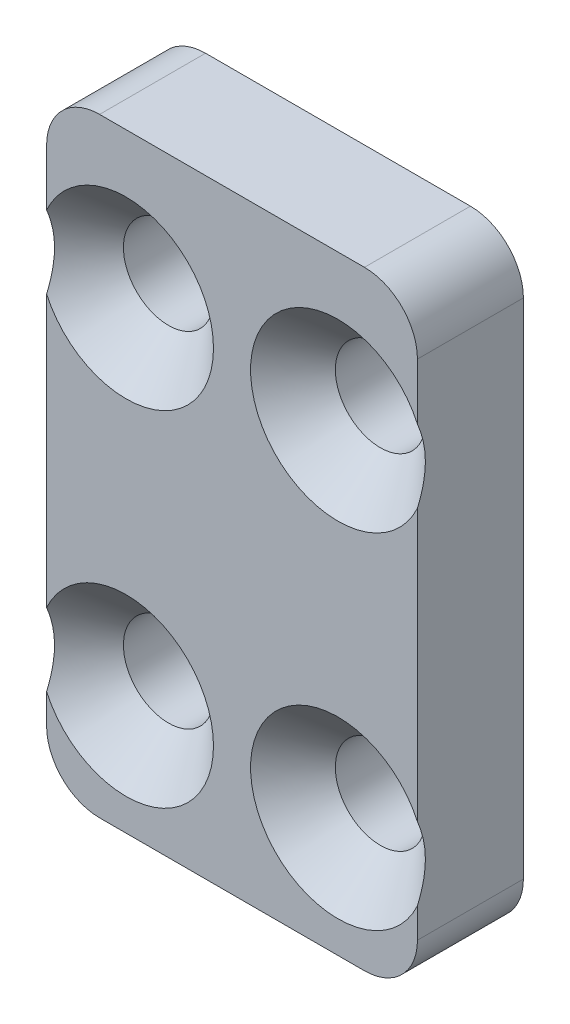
ISO-10303-21;
HEADER;
FILE_DESCRIPTION(('STEP AP214'),'2;1');
FILE_NAME('part.step','',(''),(''),'','','');
FILE_SCHEMA(('AUTOMOTIVE_DESIGN { 1 0 10303 214 1 1 1 1 }'));
ENDSEC;
DATA;
#1=APPLICATION_CONTEXT('core data for automotive mechanical design processes');
#2=APPLICATION_PROTOCOL_DEFINITION('international standard','automotive_design',2000,#1);
#3=PRODUCT_CONTEXT('',#1,'mechanical');
#4=PRODUCT('Part','Part','',(#3));
#5=PRODUCT_RELATED_PRODUCT_CATEGORY('part','',(#4));
#6=PRODUCT_DEFINITION_FORMATION('','',#4);
#7=PRODUCT_DEFINITION_CONTEXT('part definition',#1,'design');
#8=PRODUCT_DEFINITION('design','',#6,#7);
#9=PRODUCT_DEFINITION_SHAPE('','',#8);
#10=(LENGTH_UNIT() NAMED_UNIT(*) SI_UNIT(.MILLI.,.METRE.));
#11=(NAMED_UNIT(*) PLANE_ANGLE_UNIT() SI_UNIT($,.RADIAN.));
#12=(NAMED_UNIT(*) SI_UNIT($,.STERADIAN.) SOLID_ANGLE_UNIT());
#13=UNCERTAINTY_MEASURE_WITH_UNIT(LENGTH_MEASURE(1.E-05),#10,'distance_accuracy_value','');
#14=(GEOMETRIC_REPRESENTATION_CONTEXT(3) GLOBAL_UNCERTAINTY_ASSIGNED_CONTEXT((#13)) GLOBAL_UNIT_ASSIGNED_CONTEXT((#10,
#11,#12)) REPRESENTATION_CONTEXT('',''));
#15=CARTESIAN_POINT('',(0.,0.,0.));
#16=DIRECTION('',(0.,0.,1.));
#17=DIRECTION('',(1.,0.,0.));
#18=AXIS2_PLACEMENT_3D('',#15,#16,#17);
#19=CARTESIAN_POINT('',(7.,11.5,4.));
#20=DIRECTION('',(-1.,0.,0.));
#21=DIRECTION('',(0.,-1.,0.));
#22=AXIS2_PLACEMENT_3D('',#19,#20,#21);
#23=PLANE('',#22);
#24=DIRECTION('',(0.,1.,0.));
#25=VECTOR('',#24,1.);
#26=CARTESIAN_POINT('',(7.,11.5,4.));
#27=LINE('',#26,#25);
#28=CARTESIAN_POINT('',(7.,-9.5,4.));
#29=VERTEX_POINT('',#28);
#30=CARTESIAN_POINT('',(7.,-8.37477270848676,4.));
#31=VERTEX_POINT('',#30);
#32=EDGE_CURVE('E346',#29,#31,#27,.T.);
#33=ORIENTED_EDGE('',*,*,#32,.F.);
#34=DIRECTION('',(0.,0.,-1.));
#35=VECTOR('',#34,1.);
#36=CARTESIAN_POINT('',(7.,-9.5,4.));
#37=LINE('',#36,#35);
#38=CARTESIAN_POINT('',(7.,-9.5,0.));
#39=VERTEX_POINT('',#38);
#40=EDGE_CURVE('E292',#29,#39,#37,.T.);
#41=ORIENTED_EDGE('',*,*,#40,.T.);
#42=DIRECTION('',(0.,1.,0.));
#43=VECTOR('',#42,1.);
#44=CARTESIAN_POINT('',(7.,11.5,0.));
#45=LINE('',#44,#43);
#46=CARTESIAN_POINT('',(7.,9.5,0.));
#47=VERTEX_POINT('',#46);
#48=EDGE_CURVE('E161',#39,#47,#45,.T.);
#49=ORIENTED_EDGE('',*,*,#48,.T.);
#50=DIRECTION('',(0.,0.,-1.));
#51=VECTOR('',#50,1.);
#52=CARTESIAN_POINT('',(7.,9.5,4.));
#53=LINE('',#52,#51);
#54=CARTESIAN_POINT('',(7.,9.5,4.));
#55=VERTEX_POINT('',#54);
#56=EDGE_CURVE('E135',#47,#55,#53,.F.);
#57=ORIENTED_EDGE('',*,*,#56,.T.);
#58=CARTESIAN_POINT('',(7.,7.37477270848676,4.));
#59=VERTEX_POINT('',#58);
#60=EDGE_CURVE('E172',#59,#55,#27,.T.);
#61=ORIENTED_EDGE('',*,*,#60,.F.);
#62=CARTESIAN_POINT('',(7.,-5.36840136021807,12.4575741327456));
#63=CARTESIAN_POINT('',(7.,-5.07180927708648,12.1708251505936));
#64=CARTESIAN_POINT('',(7.,-4.7748761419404,11.8844273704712));
#65=CARTESIAN_POINT('',(7.,-4.18006128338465,11.3125770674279));
#66=CARTESIAN_POINT('',(7.,-3.8821794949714,11.0271246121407));
#67=CARTESIAN_POINT('',(7.,-3.28429415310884,10.4565431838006));
#68=CARTESIAN_POINT('',(7.,-2.98428686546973,10.1714181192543));
#69=CARTESIAN_POINT('',(7.,-2.38272797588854,9.60283572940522));
#70=CARTESIAN_POINT('',(7.,-2.08117646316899,9.31937830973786));
#71=CARTESIAN_POINT('',(7.,-1.43806962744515,8.71933506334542));
#72=CARTESIAN_POINT('',(7.,-1.09623513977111,8.40304741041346));
#73=CARTESIAN_POINT('',(7.,-0.580531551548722,7.93177603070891));
#74=CARTESIAN_POINT('',(7.,-0.408120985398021,7.7751967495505));
#75=CARTESIAN_POINT('',(7.,-0.0620916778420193,7.46337990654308));
#76=CARTESIAN_POINT('',(7.,0.111527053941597,7.30814233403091));
#77=CARTESIAN_POINT('',(7.,0.4599584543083,6.99964382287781));
#78=CARTESIAN_POINT('',(7.,0.634768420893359,6.84637983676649));
#79=CARTESIAN_POINT('',(7.,0.986288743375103,6.54205018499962));
#80=CARTESIAN_POINT('',(7.,1.16299905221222,6.3909844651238));
#81=CARTESIAN_POINT('',(7.,1.51882169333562,6.09181593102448));
#82=CARTESIAN_POINT('',(7.,1.69793326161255,5.94371221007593));
#83=CARTESIAN_POINT('',(7.,2.05936788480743,5.65148687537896));
#84=CARTESIAN_POINT('',(7.,2.24169060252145,5.50736484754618));
#85=CARTESIAN_POINT('',(7.,2.52171426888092,5.29289996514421));
#86=CARTESIAN_POINT('',(7.,2.61783062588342,5.22048880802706));
#87=CARTESIAN_POINT('',(7.,2.81143858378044,5.07751676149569));
#88=CARTESIAN_POINT('',(7.,2.90893022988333,5.00695593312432));
#89=CARTESIAN_POINT('',(7.,3.10566271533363,4.86801295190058));
#90=CARTESIAN_POINT('',(7.,3.20490580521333,4.799633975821));
#91=CARTESIAN_POINT('',(7.,3.40529553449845,4.66571968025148));
#92=CARTESIAN_POINT('',(7.,3.50644210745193,4.600184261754));
#93=CARTESIAN_POINT('',(7.,3.70934385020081,4.47371321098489));
#94=CARTESIAN_POINT('',(7.,3.81106343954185,4.41272079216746));
#95=CARTESIAN_POINT('',(7.,4.01705289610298,4.29512521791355));
#96=CARTESIAN_POINT('',(7.,4.12132323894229,4.23852288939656));
#97=CARTESIAN_POINT('',(7.,4.33251787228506,4.13107127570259));
#98=CARTESIAN_POINT('',(7.,4.43943568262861,4.08020936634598));
#99=CARTESIAN_POINT('',(7.,4.65638293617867,3.98569413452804));
#100=CARTESIAN_POINT('',(7.,4.76641047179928,3.94203650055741));
#101=CARTESIAN_POINT('',(7.,4.97106380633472,3.87035116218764));
#102=CARTESIAN_POINT('',(7.,5.06519782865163,3.84093106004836));
#103=CARTESIAN_POINT('',(7.,5.25552659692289,3.78963604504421));
#104=CARTESIAN_POINT('',(7.,5.35172123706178,3.76776074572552));
#105=CARTESIAN_POINT('',(7.,5.54513443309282,3.73280701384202));
#106=CARTESIAN_POINT('',(7.,5.64234358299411,3.71967737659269));
#107=CARTESIAN_POINT('',(7.,5.83758067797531,3.70282034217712));
#108=CARTESIAN_POINT('',(7.,5.93560854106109,3.69909201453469));
#109=CARTESIAN_POINT('',(7.,6.12884829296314,3.70125360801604));
#110=CARTESIAN_POINT('',(7.,6.22406327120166,3.70688105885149));
#111=CARTESIAN_POINT('',(7.,6.41355685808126,3.72690377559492));
#112=CARTESIAN_POINT('',(7.,6.5078354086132,3.74129958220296));
#113=CARTESIAN_POINT('',(7.,6.69534741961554,3.77814880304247));
#114=CARTESIAN_POINT('',(7.,6.78857165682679,3.8006484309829));
#115=CARTESIAN_POINT('',(7.,6.97303865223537,3.85261238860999));
#116=CARTESIAN_POINT('',(7.,7.06428124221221,3.88207730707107));
#117=CARTESIAN_POINT('',(7.,7.25544978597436,3.95073305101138));
#118=CARTESIAN_POINT('',(7.,7.3551068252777,3.99066609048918));
#119=CARTESIAN_POINT('',(7.,7.55184899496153,4.07644663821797));
#120=CARTESIAN_POINT('',(7.,7.6489332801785,4.12229606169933));
#121=CARTESIAN_POINT('',(7.,7.84087792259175,4.21879767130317));
#122=CARTESIAN_POINT('',(7.,7.93573411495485,4.26945807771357));
#123=CARTESIAN_POINT('',(7.,8.12329594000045,4.37455496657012));
#124=CARTESIAN_POINT('',(7.,8.21600193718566,4.42899080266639));
#125=CARTESIAN_POINT('',(7.,8.40076409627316,4.54164508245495));
#126=CARTESIAN_POINT('',(7.,8.49279544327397,4.59990403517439));
#127=CARTESIAN_POINT('',(7.,8.67520573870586,4.71894917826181));
#128=CARTESIAN_POINT('',(7.,8.76558464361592,4.77973543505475));
#129=CARTESIAN_POINT('',(7.,8.94482375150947,4.90330531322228));
#130=CARTESIAN_POINT('',(7.,9.03368543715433,4.96608679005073));
#131=CARTESIAN_POINT('',(7.,9.21017587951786,5.09334761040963));
#132=CARTESIAN_POINT('',(7.,9.29780468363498,5.15782688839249));
#133=CARTESIAN_POINT('',(7.,9.58906831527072,5.37578544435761));
#134=CARTESIAN_POINT('',(7.,9.79034243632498,5.53241954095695));
#135=CARTESIAN_POINT('',(7.,10.1887602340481,5.85087046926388));
#136=CARTESIAN_POINT('',(7.,10.3859032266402,6.01268814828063));
#137=CARTESIAN_POINT('',(7.,10.7772121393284,6.34005959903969));
#138=CARTESIAN_POINT('',(7.,10.971376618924,6.50561508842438));
#139=CARTESIAN_POINT('',(7.,11.357392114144,6.83940326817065));
#140=CARTESIAN_POINT('',(7.,11.5492430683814,7.0076360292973));
#141=CARTESIAN_POINT('',(7.,11.9315801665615,7.34648694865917));
#142=CARTESIAN_POINT('',(7.,12.1220623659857,7.51710955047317));
#143=CARTESIAN_POINT('',(7.,12.5016176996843,7.85991797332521));
#144=CARTESIAN_POINT('',(7.,12.6906908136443,8.03210381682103));
#145=CARTESIAN_POINT('',(7.,13.2561253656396,8.5503808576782));
#146=CARTESIAN_POINT('',(7.,13.6308163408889,8.89829367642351));
#147=CARTESIAN_POINT('',(7.,14.333315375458,9.55612567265));
#148=CARTESIAN_POINT('',(7.,14.6614506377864,9.86569673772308));
#149=CARTESIAN_POINT('',(7.,15.3160656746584,10.486640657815));
#150=CARTESIAN_POINT('',(7.,15.6425453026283,10.7980136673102));
#151=CARTESIAN_POINT('',(7.,16.2929592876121,11.420832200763));
#152=CARTESIAN_POINT('',(7.,16.6168986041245,11.7322725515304));
#153=CARTESIAN_POINT('',(7.,17.2637709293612,12.3561319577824));
#154=CARTESIAN_POINT('',(7.,17.5867040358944,12.6685509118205));
#155=CARTESIAN_POINT('',(7.,17.9092856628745,12.9813307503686));
#156=B_SPLINE_CURVE_WITH_KNOTS('',3,(#62,#63,#64,#65,#66,#67,#68,#69,#70,#71,#72,#73,#74,#75,
#76,#77,#78,#79,#80,#81,#82,#83,#84,#85,#86,#87,#88,#89,#90,#91,#92,#93,#94,#95,#96,#97,#98,#99,
#100,#101,#102,#103,#104,#105,#106,#107,#108,#109,#110,#111,#112,#113,#114,#115,#116,#117,#118,
#119,#120,#121,#122,#123,#124,#125,#126,#127,#128,#129,#130,#131,#132,#133,#134,#135,#136,#137,
#138,#139,#140,#141,#142,#143,#144,#145,#146,#147,#148,#149,#150,#151,#152,#153,#154,#155),
.UNSPECIFIED.,.F.,.F.,(4,2,2,2,2,2,2,2,2,2,2,2,2,2,2,2,2,2,2,2,2,2,2,2,2,2,2,2,2,2,2,2,2,2,2,2,
2,2,2,2,2,2,2,2,2,2,4),(0.,1.2376307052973,2.47534812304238,3.7169975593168,4.95857604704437,
6.35568684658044,7.05438204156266,7.75307167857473,8.45050736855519,9.14792582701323,
9.8451274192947,10.5422562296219,10.9032592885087,11.2642742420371,11.6257928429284,
11.9872988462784,12.3430255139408,12.6988190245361,13.053814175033,13.4085960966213,
13.7042074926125,13.9998037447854,14.2936537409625,14.5874746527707,14.8731908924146,
15.1589247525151,15.4463145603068,15.7337286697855,16.0555676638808,16.3775111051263,
16.7000148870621,17.022463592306,17.3491773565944,17.6758997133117,18.0022820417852,
18.3286517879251,19.0936235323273,19.8587209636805,20.6241774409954,21.3896541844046,
22.1568196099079,22.9239960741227,24.4578891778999,25.8112351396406,27.1646988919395,
28.5128012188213,29.8607681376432),.UNSPECIFIED.);
#157=CARTESIAN_POINT('',(7.,4.62522729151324,4.));
#158=VERTEX_POINT('',#157);
#159=EDGE_CURVE('E196',#59,#158,#156,.F.);
#160=ORIENTED_EDGE('',*,*,#159,.T.);
#161=CARTESIAN_POINT('',(7.,-5.62522729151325,4.));
#162=VERTEX_POINT('',#161);
#163=EDGE_CURVE('E349',#162,#158,#27,.T.);
#164=ORIENTED_EDGE('',*,*,#163,.F.);
#165=CARTESIAN_POINT('',(7.,-18.3684013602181,12.4575741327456));
#166=CARTESIAN_POINT('',(7.,-18.0718092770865,12.1708251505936));
#167=CARTESIAN_POINT('',(7.,-17.7748761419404,11.8844273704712));
#168=CARTESIAN_POINT('',(7.,-17.1800612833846,11.3125770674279));
#169=CARTESIAN_POINT('',(7.,-16.8821794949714,11.0271246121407));
#170=CARTESIAN_POINT('',(7.,-16.2842941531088,10.4565431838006));
#171=CARTESIAN_POINT('',(7.,-15.9842868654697,10.1714181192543));
#172=CARTESIAN_POINT('',(7.,-15.3827279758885,9.60283572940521));
#173=CARTESIAN_POINT('',(7.,-15.081176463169,9.31937830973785));
#174=CARTESIAN_POINT('',(7.,-14.4380696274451,8.71933506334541));
#175=CARTESIAN_POINT('',(7.,-14.0962351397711,8.40304741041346));
#176=CARTESIAN_POINT('',(7.,-13.5805315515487,7.93177603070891));
#177=CARTESIAN_POINT('',(7.,-13.408120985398,7.77519674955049));
#178=CARTESIAN_POINT('',(7.,-13.062091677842,7.46337990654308));
#179=CARTESIAN_POINT('',(7.,-12.8884729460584,7.30814233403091));
#180=CARTESIAN_POINT('',(7.,-12.5400415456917,6.99964382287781));
#181=CARTESIAN_POINT('',(7.,-12.3652315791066,6.84637983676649));
#182=CARTESIAN_POINT('',(7.,-12.0137112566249,6.54205018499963));
#183=CARTESIAN_POINT('',(7.,-11.8370009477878,6.3909844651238));
#184=CARTESIAN_POINT('',(7.,-11.4811783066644,6.09181593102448));
#185=CARTESIAN_POINT('',(7.,-11.3020667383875,5.94371221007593));
#186=CARTESIAN_POINT('',(7.,-10.9406321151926,5.65148687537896));
#187=CARTESIAN_POINT('',(7.,-10.7583093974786,5.50736484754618));
#188=CARTESIAN_POINT('',(7.,-10.4782857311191,5.29289996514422));
#189=CARTESIAN_POINT('',(7.,-10.3821693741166,5.22048880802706));
#190=CARTESIAN_POINT('',(7.,-10.1885614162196,5.07751676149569));
#191=CARTESIAN_POINT('',(7.,-10.0910697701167,5.00695593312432));
#192=CARTESIAN_POINT('',(7.,-9.89433728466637,4.86801295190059));
#193=CARTESIAN_POINT('',(7.,-9.79509419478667,4.799633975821));
#194=CARTESIAN_POINT('',(7.,-9.59470446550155,4.66571968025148));
#195=CARTESIAN_POINT('',(7.,-9.49355789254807,4.600184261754));
#196=CARTESIAN_POINT('',(7.,-9.29065614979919,4.47371321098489));
#197=CARTESIAN_POINT('',(7.,-9.18893656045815,4.41272079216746));
#198=CARTESIAN_POINT('',(7.,-8.98294710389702,4.29512521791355));
#199=CARTESIAN_POINT('',(7.,-8.87867676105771,4.23852288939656));
#200=CARTESIAN_POINT('',(7.,-8.66748212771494,4.13107127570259));
#201=CARTESIAN_POINT('',(7.,-8.56056431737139,4.08020936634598));
#202=CARTESIAN_POINT('',(7.,-8.34361706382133,3.98569413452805));
#203=CARTESIAN_POINT('',(7.,-8.23358952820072,3.94203650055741));
#204=CARTESIAN_POINT('',(7.,-8.02893619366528,3.87035116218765));
#205=CARTESIAN_POINT('',(7.,-7.93480217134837,3.84093106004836));
#206=CARTESIAN_POINT('',(7.,-7.74447340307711,3.78963604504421));
#207=CARTESIAN_POINT('',(7.,-7.64827876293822,3.76776074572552));
#208=CARTESIAN_POINT('',(7.,-7.45486556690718,3.73280701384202));
#209=CARTESIAN_POINT('',(7.,-7.35765641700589,3.7196773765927));
#210=CARTESIAN_POINT('',(7.,-7.16241932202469,3.70282034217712));
#211=CARTESIAN_POINT('',(7.,-7.06439145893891,3.69909201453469));
#212=CARTESIAN_POINT('',(7.,-6.87115170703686,3.70125360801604));
#213=CARTESIAN_POINT('',(7.,-6.77593672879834,3.70688105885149));
#214=CARTESIAN_POINT('',(7.,-6.58644314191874,3.72690377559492));
#215=CARTESIAN_POINT('',(7.,-6.4921645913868,3.74129958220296));
#216=CARTESIAN_POINT('',(7.,-6.30465258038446,3.77814880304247));
#217=CARTESIAN_POINT('',(7.,-6.21142834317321,3.8006484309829));
#218=CARTESIAN_POINT('',(7.,-6.02696134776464,3.85261238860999));
#219=CARTESIAN_POINT('',(7.,-5.93571875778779,3.88207730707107));
#220=CARTESIAN_POINT('',(7.,-5.74455021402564,3.95073305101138));
#221=CARTESIAN_POINT('',(7.,-5.64489317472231,3.99066609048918));
#222=CARTESIAN_POINT('',(7.,-5.44815100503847,4.07644663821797));
#223=CARTESIAN_POINT('',(7.,-5.3510667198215,4.12229606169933));
#224=CARTESIAN_POINT('',(7.,-5.15912207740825,4.21879767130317));
#225=CARTESIAN_POINT('',(7.,-5.06426588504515,4.26945807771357));
#226=CARTESIAN_POINT('',(7.,-4.87670405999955,4.37455496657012));
#227=CARTESIAN_POINT('',(7.,-4.78399806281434,4.42899080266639));
#228=CARTESIAN_POINT('',(7.,-4.59923590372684,4.54164508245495));
#229=CARTESIAN_POINT('',(7.,-4.50720455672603,4.59990403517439));
#230=CARTESIAN_POINT('',(7.,-4.32479426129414,4.71894917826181));
#231=CARTESIAN_POINT('',(7.,-4.23441535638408,4.77973543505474));
#232=CARTESIAN_POINT('',(7.,-4.05517624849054,4.90330531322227));
#233=CARTESIAN_POINT('',(7.,-3.96631456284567,4.96608679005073));
#234=CARTESIAN_POINT('',(7.,-3.78982412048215,5.09334761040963));
#235=CARTESIAN_POINT('',(7.,-3.70219531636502,5.15782688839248));
#236=CARTESIAN_POINT('',(7.,-3.41093168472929,5.3757854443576));
#237=CARTESIAN_POINT('',(7.,-3.20965756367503,5.53241954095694));
#238=CARTESIAN_POINT('',(7.,-2.81123976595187,5.85087046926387));
#239=CARTESIAN_POINT('',(7.,-2.61409677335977,6.01268814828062));
#240=CARTESIAN_POINT('',(7.,-2.22278786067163,6.34005959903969));
#241=CARTESIAN_POINT('',(7.,-2.02862338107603,6.50561508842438));
#242=CARTESIAN_POINT('',(7.,-1.64260788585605,6.83940326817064));
#243=CARTESIAN_POINT('',(7.,-1.45075693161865,7.00763602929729));
#244=CARTESIAN_POINT('',(7.,-1.06841983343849,7.34648694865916));
#245=CARTESIAN_POINT('',(7.,-0.877937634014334,7.51710955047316));
#246=CARTESIAN_POINT('',(7.,-0.498382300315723,7.8599179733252));
#247=CARTESIAN_POINT('',(7.,-0.309309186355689,8.03210381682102));
#248=CARTESIAN_POINT('',(7.,0.256125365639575,8.55038085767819));
#249=CARTESIAN_POINT('',(7.,0.630816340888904,8.8982936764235));
#250=CARTESIAN_POINT('',(7.,1.33331537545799,9.55612567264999));
#251=CARTESIAN_POINT('',(7.,1.66145063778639,9.86569673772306));
#252=CARTESIAN_POINT('',(7.,2.31606567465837,10.4866406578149));
#253=CARTESIAN_POINT('',(7.,2.64254530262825,10.7980136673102));
#254=CARTESIAN_POINT('',(7.,3.29295928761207,11.420832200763));
#255=CARTESIAN_POINT('',(7.,3.61689860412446,11.7322725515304));
#256=CARTESIAN_POINT('',(7.,4.26377092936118,12.3561319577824));
#257=CARTESIAN_POINT('',(7.,4.58670403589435,12.6685509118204));
#258=CARTESIAN_POINT('',(7.,4.90928566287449,12.9813307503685));
#259=B_SPLINE_CURVE_WITH_KNOTS('',3,(#165,#166,#167,#168,#169,#170,#171,#172,#173,#174,#175,
#176,#177,#178,#179,#180,#181,#182,#183,#184,#185,#186,#187,#188,#189,#190,#191,#192,#193,#194,
#195,#196,#197,#198,#199,#200,#201,#202,#203,#204,#205,#206,#207,#208,#209,#210,#211,#212,#213,
#214,#215,#216,#217,#218,#219,#220,#221,#222,#223,#224,#225,#226,#227,#228,#229,#230,#231,#232,
#233,#234,#235,#236,#237,#238,#239,#240,#241,#242,#243,#244,#245,#246,#247,#248,#249,#250,#251,
#252,#253,#254,#255,#256,#257,#258),.UNSPECIFIED.,.F.,.F.,(4,2,2,2,2,2,2,2,2,2,2,2,2,2,2,2,2,2,
2,2,2,2,2,2,2,2,2,2,2,2,2,2,2,2,2,2,2,2,2,2,2,2,2,2,2,2,4),(0.,1.2376307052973,2.47534812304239,
3.71699755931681,4.95857604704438,6.35568684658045,7.05438204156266,7.75307167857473,
8.45050736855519,9.14792582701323,9.8451274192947,10.5422562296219,10.9032592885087,
11.2642742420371,11.6257928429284,11.9872988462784,12.3430255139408,12.6988190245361,
13.053814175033,13.4085960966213,13.7042074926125,13.9998037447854,14.2936537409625,
14.5874746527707,14.8731908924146,15.1589247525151,15.4463145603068,15.7337286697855,
16.0555676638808,16.3775111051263,16.7000148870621,17.022463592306,17.3491773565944,
17.6758997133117,18.0022820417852,18.3286517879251,19.0936235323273,19.8587209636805,
20.6241774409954,21.3896541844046,22.1568196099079,22.9239960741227,24.4578891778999,
25.8112351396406,27.1646988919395,28.5128012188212,29.8607681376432),.UNSPECIFIED.);
#260=EDGE_CURVE('E160',#162,#31,#259,.F.);
#261=ORIENTED_EDGE('',*,*,#260,.T.);
#262=EDGE_LOOP('',(#33,#41,#49,#57,#61,#160,#164,#261));
#263=FACE_BOUND('',#262,.T.);
#264=ADVANCED_FACE('F39',(#263),#23,.F.);
#265=CARTESIAN_POINT('',(-7.,11.5,4.));
#266=DIRECTION('',(0.,-1.,0.));
#267=DIRECTION('',(0.,0.,-1.));
#268=AXIS2_PLACEMENT_3D('',#265,#266,#267);
#269=PLANE('',#268);
#270=DIRECTION('',(-1.,0.,0.));
#271=VECTOR('',#270,1.);
#272=CARTESIAN_POINT('',(-7.,11.5,4.));
#273=LINE('',#272,#271);
#274=CARTESIAN_POINT('',(5.,11.5,4.));
#275=VERTEX_POINT('',#274);
#276=CARTESIAN_POINT('',(-5.,11.5,4.));
#277=VERTEX_POINT('',#276);
#278=EDGE_CURVE('E155',#275,#277,#273,.T.);
#279=ORIENTED_EDGE('',*,*,#278,.F.);
#280=DIRECTION('',(0.,0.,-1.));
#281=VECTOR('',#280,1.);
#282=CARTESIAN_POINT('',(5.,11.5,4.));
#283=LINE('',#282,#281);
#284=CARTESIAN_POINT('',(5.,11.5,0.));
#285=VERTEX_POINT('',#284);
#286=EDGE_CURVE('E11',#275,#285,#283,.T.);
#287=ORIENTED_EDGE('',*,*,#286,.T.);
#288=DIRECTION('',(-1.,0.,0.));
#289=VECTOR('',#288,1.);
#290=CARTESIAN_POINT('',(-7.,11.5,0.));
#291=LINE('',#290,#289);
#292=CARTESIAN_POINT('',(-5.,11.5,0.));
#293=VERTEX_POINT('',#292);
#294=EDGE_CURVE('E164',#285,#293,#291,.T.);
#295=ORIENTED_EDGE('',*,*,#294,.T.);
#296=DIRECTION('',(0.,0.,-1.));
#297=VECTOR('',#296,1.);
#298=CARTESIAN_POINT('',(-5.,11.5,4.));
#299=LINE('',#298,#297);
#300=EDGE_CURVE('E47',#293,#277,#299,.F.);
#301=ORIENTED_EDGE('',*,*,#300,.T.);
#302=EDGE_LOOP('',(#279,#287,#295,#301));
#303=FACE_BOUND('',#302,.T.);
#304=ADVANCED_FACE('F189',(#303),#269,.F.);
#305=CARTESIAN_POINT('',(-7.,11.5,4.));
#306=DIRECTION('',(1.,0.,0.));
#307=DIRECTION('',(0.,1.,0.));
#308=AXIS2_PLACEMENT_3D('',#305,#306,#307);
#309=PLANE('',#308);
#310=DIRECTION('',(0.,-1.,0.));
#311=VECTOR('',#310,1.);
#312=CARTESIAN_POINT('',(-7.,11.5,0.));
#313=LINE('',#312,#311);
#314=CARTESIAN_POINT('',(-7.,9.5,0.));
#315=VERTEX_POINT('',#314);
#316=CARTESIAN_POINT('',(-7.,-9.5,0.));
#317=VERTEX_POINT('',#316);
#318=EDGE_CURVE('E167',#315,#317,#313,.T.);
#319=ORIENTED_EDGE('',*,*,#318,.T.);
#320=DIRECTION('',(0.,0.,-1.));
#321=VECTOR('',#320,1.);
#322=CARTESIAN_POINT('',(-7.,-9.5,4.));
#323=LINE('',#322,#321);
#324=CARTESIAN_POINT('',(-7.,-9.5,4.));
#325=VERTEX_POINT('',#324);
#326=EDGE_CURVE('E319',#317,#325,#323,.F.);
#327=ORIENTED_EDGE('',*,*,#326,.T.);
#328=DIRECTION('',(0.,-1.,0.));
#329=VECTOR('',#328,1.);
#330=CARTESIAN_POINT('',(-7.,11.5,4.));
#331=LINE('',#330,#329);
#332=CARTESIAN_POINT('',(-7.,-8.37477270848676,4.));
#333=VERTEX_POINT('',#332);
#334=EDGE_CURVE('E151',#333,#325,#331,.T.);
#335=ORIENTED_EDGE('',*,*,#334,.F.);
#336=CARTESIAN_POINT('',(-7.,-18.3684013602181,12.4575741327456));
#337=CARTESIAN_POINT('',(-7.,-18.0718092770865,12.1708251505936));
#338=CARTESIAN_POINT('',(-7.,-17.7748761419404,11.8844273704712));
#339=CARTESIAN_POINT('',(-7.,-17.1800612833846,11.3125770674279));
#340=CARTESIAN_POINT('',(-7.,-16.8821794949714,11.0271246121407));
#341=CARTESIAN_POINT('',(-7.,-16.2842941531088,10.4565431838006));
#342=CARTESIAN_POINT('',(-7.,-15.9842868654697,10.1714181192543));
#343=CARTESIAN_POINT('',(-7.,-15.3827279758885,9.60283572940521));
#344=CARTESIAN_POINT('',(-7.,-15.081176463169,9.31937830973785));
#345=CARTESIAN_POINT('',(-7.,-14.4380696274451,8.71933506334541));
#346=CARTESIAN_POINT('',(-7.,-14.0962351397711,8.40304741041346));
#347=CARTESIAN_POINT('',(-7.,-13.5805315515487,7.93177603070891));
#348=CARTESIAN_POINT('',(-7.,-13.408120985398,7.77519674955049));
#349=CARTESIAN_POINT('',(-7.,-13.062091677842,7.46337990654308));
#350=CARTESIAN_POINT('',(-7.,-12.8884729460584,7.30814233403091));
#351=CARTESIAN_POINT('',(-7.,-12.5400415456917,6.99964382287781));
#352=CARTESIAN_POINT('',(-7.,-12.3652315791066,6.84637983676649));
#353=CARTESIAN_POINT('',(-7.,-12.0137112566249,6.54205018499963));
#354=CARTESIAN_POINT('',(-7.,-11.8370009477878,6.3909844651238));
#355=CARTESIAN_POINT('',(-7.,-11.4811783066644,6.09181593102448));
#356=CARTESIAN_POINT('',(-7.,-11.3020667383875,5.94371221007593));
#357=CARTESIAN_POINT('',(-7.,-10.9406321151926,5.65148687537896));
#358=CARTESIAN_POINT('',(-7.,-10.7583093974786,5.50736484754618));
#359=CARTESIAN_POINT('',(-7.,-10.4782857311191,5.29289996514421));
#360=CARTESIAN_POINT('',(-7.,-10.3821693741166,5.22048880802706));
#361=CARTESIAN_POINT('',(-7.,-10.1885614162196,5.07751676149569));
#362=CARTESIAN_POINT('',(-7.,-10.0910697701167,5.00695593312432));
#363=CARTESIAN_POINT('',(-7.,-9.89433728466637,4.86801295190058));
#364=CARTESIAN_POINT('',(-7.,-9.79509419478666,4.799633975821));
#365=CARTESIAN_POINT('',(-7.,-9.59470446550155,4.66571968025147));
#366=CARTESIAN_POINT('',(-7.,-9.49355789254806,4.600184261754));
#367=CARTESIAN_POINT('',(-7.,-9.29065614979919,4.47371321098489));
#368=CARTESIAN_POINT('',(-7.,-9.18893656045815,4.41272079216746));
#369=CARTESIAN_POINT('',(-7.,-8.98294710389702,4.29512521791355));
#370=CARTESIAN_POINT('',(-7.,-8.87867676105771,4.23852288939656));
#371=CARTESIAN_POINT('',(-7.,-8.66748212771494,4.13107127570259));
#372=CARTESIAN_POINT('',(-7.,-8.56056431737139,4.08020936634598));
#373=CARTESIAN_POINT('',(-7.,-8.34361706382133,3.98569413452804));
#374=CARTESIAN_POINT('',(-7.,-8.23358952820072,3.94203650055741));
#375=CARTESIAN_POINT('',(-7.,-8.02893619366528,3.87035116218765));
#376=CARTESIAN_POINT('',(-7.,-7.93480217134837,3.84093106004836));
#377=CARTESIAN_POINT('',(-7.,-7.74447340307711,3.78963604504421));
#378=CARTESIAN_POINT('',(-7.,-7.64827876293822,3.76776074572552));
#379=CARTESIAN_POINT('',(-7.,-7.45486556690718,3.73280701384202));
#380=CARTESIAN_POINT('',(-7.,-7.35765641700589,3.7196773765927));
#381=CARTESIAN_POINT('',(-7.,-7.16241932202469,3.70282034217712));
#382=CARTESIAN_POINT('',(-7.,-7.06439145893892,3.69909201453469));
#383=CARTESIAN_POINT('',(-7.,-6.87115170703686,3.70125360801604));
#384=CARTESIAN_POINT('',(-7.,-6.77593672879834,3.70688105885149));
#385=CARTESIAN_POINT('',(-7.,-6.58644314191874,3.72690377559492));
#386=CARTESIAN_POINT('',(-7.,-6.4921645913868,3.74129958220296));
#387=CARTESIAN_POINT('',(-7.,-6.30465258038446,3.77814880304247));
#388=CARTESIAN_POINT('',(-7.,-6.21142834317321,3.8006484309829));
#389=CARTESIAN_POINT('',(-7.,-6.02696134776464,3.85261238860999));
#390=CARTESIAN_POINT('',(-7.,-5.93571875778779,3.88207730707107));
#391=CARTESIAN_POINT('',(-7.,-5.74455021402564,3.95073305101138));
#392=CARTESIAN_POINT('',(-7.,-5.64489317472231,3.99066609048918));
#393=CARTESIAN_POINT('',(-7.,-5.44815100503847,4.07644663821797));
#394=CARTESIAN_POINT('',(-7.,-5.3510667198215,4.12229606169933));
#395=CARTESIAN_POINT('',(-7.,-5.15912207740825,4.21879767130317));
#396=CARTESIAN_POINT('',(-7.,-5.06426588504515,4.26945807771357));
#397=CARTESIAN_POINT('',(-7.,-4.87670405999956,4.37455496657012));
#398=CARTESIAN_POINT('',(-7.,-4.78399806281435,4.42899080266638));
#399=CARTESIAN_POINT('',(-7.,-4.59923590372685,4.54164508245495));
#400=CARTESIAN_POINT('',(-7.,-4.50720455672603,4.59990403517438));
#401=CARTESIAN_POINT('',(-7.,-4.32479426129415,4.71894917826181));
#402=CARTESIAN_POINT('',(-7.,-4.23441535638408,4.77973543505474));
#403=CARTESIAN_POINT('',(-7.,-4.05517624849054,4.90330531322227));
#404=CARTESIAN_POINT('',(-7.,-3.96631456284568,4.96608679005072));
#405=CARTESIAN_POINT('',(-7.,-3.78982412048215,5.09334761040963));
#406=CARTESIAN_POINT('',(-7.,-3.70219531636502,5.15782688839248));
#407=CARTESIAN_POINT('',(-7.,-3.41093168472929,5.3757854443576));
#408=CARTESIAN_POINT('',(-7.,-3.20965756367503,5.53241954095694));
#409=CARTESIAN_POINT('',(-7.,-2.81123976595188,5.85087046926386));
#410=CARTESIAN_POINT('',(-7.,-2.61409677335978,6.01268814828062));
#411=CARTESIAN_POINT('',(-7.,-2.22278786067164,6.34005959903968));
#412=CARTESIAN_POINT('',(-7.,-2.02862338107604,6.50561508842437));
#413=CARTESIAN_POINT('',(-7.,-1.64260788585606,6.83940326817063));
#414=CARTESIAN_POINT('',(-7.,-1.45075693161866,7.00763602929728));
#415=CARTESIAN_POINT('',(-7.,-1.0684198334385,7.34648694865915));
#416=CARTESIAN_POINT('',(-7.,-0.877937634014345,7.51710955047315));
#417=CARTESIAN_POINT('',(-7.,-0.498382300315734,7.8599179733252));
#418=CARTESIAN_POINT('',(-7.,-0.309309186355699,8.03210381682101));
#419=CARTESIAN_POINT('',(-7.,0.256125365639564,8.55038085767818));
#420=CARTESIAN_POINT('',(-7.,0.630816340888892,8.89829367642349));
#421=CARTESIAN_POINT('',(-7.,1.33331537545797,9.55612567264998));
#422=CARTESIAN_POINT('',(-7.,1.66145063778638,9.86569673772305));
#423=CARTESIAN_POINT('',(-7.,2.31606567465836,10.4866406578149));
#424=CARTESIAN_POINT('',(-7.,2.64254530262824,10.7980136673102));
#425=CARTESIAN_POINT('',(-7.,3.29295928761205,11.420832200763));
#426=CARTESIAN_POINT('',(-7.,3.61689860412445,11.7322725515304));
#427=CARTESIAN_POINT('',(-7.,4.26377092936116,12.3561319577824));
#428=CARTESIAN_POINT('',(-7.,4.58670403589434,12.6685509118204));
#429=CARTESIAN_POINT('',(-7.,4.90928566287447,12.9813307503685));
#430=B_SPLINE_CURVE_WITH_KNOTS('',3,(#336,#337,#338,#339,#340,#341,#342,#343,#344,#345,#346,
#347,#348,#349,#350,#351,#352,#353,#354,#355,#356,#357,#358,#359,#360,#361,#362,#363,#364,#365,
#366,#367,#368,#369,#370,#371,#372,#373,#374,#375,#376,#377,#378,#379,#380,#381,#382,#383,#384,
#385,#386,#387,#388,#389,#390,#391,#392,#393,#394,#395,#396,#397,#398,#399,#400,#401,#402,#403,
#404,#405,#406,#407,#408,#409,#410,#411,#412,#413,#414,#415,#416,#417,#418,#419,#420,#421,#422,
#423,#424,#425,#426,#427,#428,#429),.UNSPECIFIED.,.F.,.F.,(4,2,2,2,2,2,2,2,2,2,2,2,2,2,2,2,2,2,
2,2,2,2,2,2,2,2,2,2,2,2,2,2,2,2,2,2,2,2,2,2,2,2,2,2,2,2,4),(0.,1.2376307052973,2.47534812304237,
3.71699755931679,4.95857604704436,6.35568684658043,7.05438204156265,7.75307167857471,
8.45050736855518,9.14792582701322,9.84512741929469,10.5422562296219,10.9032592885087,
11.2642742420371,11.6257928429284,11.9872988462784,12.3430255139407,12.6988190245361,
13.053814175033,13.4085960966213,13.7042074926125,13.9998037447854,14.2936537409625,
14.5874746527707,14.8731908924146,15.1589247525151,15.4463145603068,15.7337286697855,
16.0555676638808,16.3775111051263,16.7000148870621,17.022463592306,17.3491773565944,
17.6758997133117,18.0022820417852,18.3286517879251,19.0936235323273,19.8587209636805,
20.6241774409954,21.3896541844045,22.1568196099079,22.9239960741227,24.4578891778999,
25.8112351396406,27.1646988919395,28.5128012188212,29.8607681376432),.UNSPECIFIED.);
#431=CARTESIAN_POINT('',(-7.,-5.62522729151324,4.));
#432=VERTEX_POINT('',#431);
#433=EDGE_CURVE('E150',#333,#432,#430,.T.);
#434=ORIENTED_EDGE('',*,*,#433,.T.);
#435=CARTESIAN_POINT('',(-7.,4.62522729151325,4.));
#436=VERTEX_POINT('',#435);
#437=EDGE_CURVE('E141',#436,#432,#331,.T.);
#438=ORIENTED_EDGE('',*,*,#437,.F.);
#439=CARTESIAN_POINT('',(-7.,-5.36840136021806,12.4575741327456));
#440=CARTESIAN_POINT('',(-7.,-5.07180927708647,12.1708251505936));
#441=CARTESIAN_POINT('',(-7.,-4.77487614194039,11.8844273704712));
#442=CARTESIAN_POINT('',(-7.,-4.18006128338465,11.3125770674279));
#443=CARTESIAN_POINT('',(-7.,-3.88217949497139,11.0271246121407));
#444=CARTESIAN_POINT('',(-7.,-3.28429415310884,10.4565431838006));
#445=CARTESIAN_POINT('',(-7.,-2.98428686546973,10.1714181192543));
#446=CARTESIAN_POINT('',(-7.,-2.38272797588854,9.60283572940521));
#447=CARTESIAN_POINT('',(-7.,-2.08117646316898,9.31937830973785));
#448=CARTESIAN_POINT('',(-7.,-1.43806962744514,8.71933506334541));
#449=CARTESIAN_POINT('',(-7.,-1.0962351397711,8.40304741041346));
#450=CARTESIAN_POINT('',(-7.,-0.580531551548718,7.93177603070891));
#451=CARTESIAN_POINT('',(-7.,-0.408120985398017,7.77519674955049));
#452=CARTESIAN_POINT('',(-7.,-0.0620916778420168,7.46337990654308));
#453=CARTESIAN_POINT('',(-7.,0.111527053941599,7.30814233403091));
#454=CARTESIAN_POINT('',(-7.,0.4599584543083,6.99964382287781));
#455=CARTESIAN_POINT('',(-7.,0.634768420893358,6.84637983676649));
#456=CARTESIAN_POINT('',(-7.,0.986288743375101,6.54205018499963));
#457=CARTESIAN_POINT('',(-7.,1.16299905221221,6.3909844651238));
#458=CARTESIAN_POINT('',(-7.,1.51882169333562,6.09181593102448));
#459=CARTESIAN_POINT('',(-7.,1.69793326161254,5.94371221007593));
#460=CARTESIAN_POINT('',(-7.,2.05936788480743,5.65148687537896));
#461=CARTESIAN_POINT('',(-7.,2.24169060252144,5.50736484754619));
#462=CARTESIAN_POINT('',(-7.,2.52171426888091,5.29289996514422));
#463=CARTESIAN_POINT('',(-7.,2.61783062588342,5.22048880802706));
#464=CARTESIAN_POINT('',(-7.,2.81143858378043,5.0775167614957));
#465=CARTESIAN_POINT('',(-7.,2.90893022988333,5.00695593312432));
#466=CARTESIAN_POINT('',(-7.,3.10566271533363,4.86801295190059));
#467=CARTESIAN_POINT('',(-7.,3.20490580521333,4.79963397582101));
#468=CARTESIAN_POINT('',(-7.,3.40529553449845,4.66571968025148));
#469=CARTESIAN_POINT('',(-7.,3.50644210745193,4.600184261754));
#470=CARTESIAN_POINT('',(-7.,3.70934385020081,4.47371321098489));
#471=CARTESIAN_POINT('',(-7.,3.81106343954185,4.41272079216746));
#472=CARTESIAN_POINT('',(-7.,4.01705289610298,4.29512521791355));
#473=CARTESIAN_POINT('',(-7.,4.12132323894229,4.23852288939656));
#474=CARTESIAN_POINT('',(-7.,4.33251787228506,4.13107127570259));
#475=CARTESIAN_POINT('',(-7.,4.43943568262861,4.08020936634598));
#476=CARTESIAN_POINT('',(-7.,4.65638293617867,3.98569413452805));
#477=CARTESIAN_POINT('',(-7.,4.76641047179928,3.94203650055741));
#478=CARTESIAN_POINT('',(-7.,4.97106380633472,3.87035116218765));
#479=CARTESIAN_POINT('',(-7.,5.06519782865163,3.84093106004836));
#480=CARTESIAN_POINT('',(-7.,5.25552659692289,3.78963604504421));
#481=CARTESIAN_POINT('',(-7.,5.35172123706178,3.76776074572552));
#482=CARTESIAN_POINT('',(-7.,5.54513443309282,3.73280701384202));
#483=CARTESIAN_POINT('',(-7.,5.64234358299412,3.7196773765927));
#484=CARTESIAN_POINT('',(-7.,5.83758067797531,3.70282034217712));
#485=CARTESIAN_POINT('',(-7.,5.93560854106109,3.69909201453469));
#486=CARTESIAN_POINT('',(-7.,6.12884829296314,3.70125360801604));
#487=CARTESIAN_POINT('',(-7.,6.22406327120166,3.70688105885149));
#488=CARTESIAN_POINT('',(-7.,6.41355685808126,3.72690377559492));
#489=CARTESIAN_POINT('',(-7.,6.5078354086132,3.74129958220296));
#490=CARTESIAN_POINT('',(-7.,6.69534741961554,3.77814880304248));
#491=CARTESIAN_POINT('',(-7.,6.78857165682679,3.8006484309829));
#492=CARTESIAN_POINT('',(-7.,6.97303865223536,3.85261238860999));
#493=CARTESIAN_POINT('',(-7.,7.06428124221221,3.88207730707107));
#494=CARTESIAN_POINT('',(-7.,7.25544978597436,3.95073305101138));
#495=CARTESIAN_POINT('',(-7.,7.35510682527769,3.99066609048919));
#496=CARTESIAN_POINT('',(-7.,7.55184899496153,4.07644663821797));
#497=CARTESIAN_POINT('',(-7.,7.6489332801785,4.12229606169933));
#498=CARTESIAN_POINT('',(-7.,7.84087792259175,4.21879767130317));
#499=CARTESIAN_POINT('',(-7.,7.93573411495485,4.26945807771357));
#500=CARTESIAN_POINT('',(-7.,8.12329594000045,4.37455496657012));
#501=CARTESIAN_POINT('',(-7.,8.21600193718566,4.42899080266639));
#502=CARTESIAN_POINT('',(-7.,8.40076409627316,4.54164508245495));
#503=CARTESIAN_POINT('',(-7.,8.49279544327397,4.59990403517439));
#504=CARTESIAN_POINT('',(-7.,8.67520573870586,4.71894917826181));
#505=CARTESIAN_POINT('',(-7.,8.76558464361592,4.77973543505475));
#506=CARTESIAN_POINT('',(-7.,8.94482375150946,4.90330531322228));
#507=CARTESIAN_POINT('',(-7.,9.03368543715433,4.96608679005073));
#508=CARTESIAN_POINT('',(-7.,9.21017587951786,5.09334761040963));
#509=CARTESIAN_POINT('',(-7.,9.29780468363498,5.15782688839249));
#510=CARTESIAN_POINT('',(-7.,9.58906831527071,5.37578544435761));
#511=CARTESIAN_POINT('',(-7.,9.79034243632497,5.53241954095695));
#512=CARTESIAN_POINT('',(-7.,10.1887602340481,5.85087046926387));
#513=CARTESIAN_POINT('',(-7.,10.3859032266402,6.01268814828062));
#514=CARTESIAN_POINT('',(-7.,10.7772121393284,6.34005959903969));
#515=CARTESIAN_POINT('',(-7.,10.971376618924,6.50561508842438));
#516=CARTESIAN_POINT('',(-7.,11.3573921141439,6.83940326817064));
#517=CARTESIAN_POINT('',(-7.,11.5492430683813,7.00763602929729));
#518=CARTESIAN_POINT('',(-7.,11.9315801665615,7.34648694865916));
#519=CARTESIAN_POINT('',(-7.,12.1220623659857,7.51710955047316));
#520=CARTESIAN_POINT('',(-7.,12.5016176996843,7.85991797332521));
#521=CARTESIAN_POINT('',(-7.,12.6906908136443,8.03210381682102));
#522=CARTESIAN_POINT('',(-7.,13.2561253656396,8.5503808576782));
#523=CARTESIAN_POINT('',(-7.,13.6308163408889,8.8982936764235));
#524=CARTESIAN_POINT('',(-7.,14.333315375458,9.55612567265));
#525=CARTESIAN_POINT('',(-7.,14.6614506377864,9.86569673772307));
#526=CARTESIAN_POINT('',(-7.,15.3160656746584,10.4866406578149));
#527=CARTESIAN_POINT('',(-7.,15.6425453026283,10.7980136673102));
#528=CARTESIAN_POINT('',(-7.,16.2929592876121,11.420832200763));
#529=CARTESIAN_POINT('',(-7.,16.6168986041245,11.7322725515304));
#530=CARTESIAN_POINT('',(-7.,17.2637709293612,12.3561319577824));
#531=CARTESIAN_POINT('',(-7.,17.5867040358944,12.6685509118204));
#532=CARTESIAN_POINT('',(-7.,17.9092856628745,12.9813307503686));
#533=B_SPLINE_CURVE_WITH_KNOTS('',3,(#439,#440,#441,#442,#443,#444,#445,#446,#447,#448,#449,
#450,#451,#452,#453,#454,#455,#456,#457,#458,#459,#460,#461,#462,#463,#464,#465,#466,#467,#468,
#469,#470,#471,#472,#473,#474,#475,#476,#477,#478,#479,#480,#481,#482,#483,#484,#485,#486,#487,
#488,#489,#490,#491,#492,#493,#494,#495,#496,#497,#498,#499,#500,#501,#502,#503,#504,#505,#506,
#507,#508,#509,#510,#511,#512,#513,#514,#515,#516,#517,#518,#519,#520,#521,#522,#523,#524,#525,
#526,#527,#528,#529,#530,#531,#532),.UNSPECIFIED.,.F.,.F.,(4,2,2,2,2,2,2,2,2,2,2,2,2,2,2,2,2,2,
2,2,2,2,2,2,2,2,2,2,2,2,2,2,2,2,2,2,2,2,2,2,2,2,2,2,2,2,4),(0.,1.23763070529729,
2.47534812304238,3.7169975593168,4.95857604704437,6.35568684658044,7.05438204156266,
7.75307167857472,8.45050736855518,9.14792582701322,9.84512741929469,10.5422562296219,
10.9032592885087,11.2642742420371,11.6257928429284,11.9872988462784,12.3430255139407,
12.6988190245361,13.053814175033,13.4085960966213,13.7042074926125,13.9998037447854,
14.2936537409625,14.5874746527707,14.8731908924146,15.1589247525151,15.4463145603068,
15.7337286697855,16.0555676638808,16.3775111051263,16.7000148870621,17.022463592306,
17.3491773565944,17.6758997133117,18.0022820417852,18.3286517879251,19.0936235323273,
19.8587209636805,20.6241774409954,21.3896541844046,22.1568196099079,22.9239960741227,
24.4578891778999,25.8112351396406,27.1646988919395,28.5128012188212,29.8607681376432),.UNSPECIFIED.);
#534=CARTESIAN_POINT('',(-7.,7.37477270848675,4.));
#535=VERTEX_POINT('',#534);
#536=EDGE_CURVE('E129',#436,#535,#533,.T.);
#537=ORIENTED_EDGE('',*,*,#536,.T.);
#538=CARTESIAN_POINT('',(-7.,9.5,4.));
#539=VERTEX_POINT('',#538);
#540=EDGE_CURVE('E143',#539,#535,#331,.T.);
#541=ORIENTED_EDGE('',*,*,#540,.F.);
#542=DIRECTION('',(0.,0.,-1.));
#543=VECTOR('',#542,1.);
#544=CARTESIAN_POINT('',(-7.,9.5,4.));
#545=LINE('',#544,#543);
#546=EDGE_CURVE('E316',#539,#315,#545,.T.);
#547=ORIENTED_EDGE('',*,*,#546,.T.);
#548=EDGE_LOOP('',(#319,#327,#335,#434,#438,#537,#541,#547));
#549=FACE_BOUND('',#548,.T.);
#550=ADVANCED_FACE('F148',(#549),#309,.F.);
#551=CARTESIAN_POINT('',(-7.,-11.5,4.));
#552=DIRECTION('',(0.,1.,0.));
#553=DIRECTION('',(0.,0.,1.));
#554=AXIS2_PLACEMENT_3D('',#551,#552,#553);
#555=PLANE('',#554);
#556=DIRECTION('',(1.,0.,0.));
#557=VECTOR('',#556,1.);
#558=CARTESIAN_POINT('',(-7.,-11.5,0.));
#559=LINE('',#558,#557);
#560=CARTESIAN_POINT('',(-5.,-11.5,0.));
#561=VERTEX_POINT('',#560);
#562=CARTESIAN_POINT('',(5.,-11.5,0.));
#563=VERTEX_POINT('',#562);
#564=EDGE_CURVE('E169',#561,#563,#559,.T.);
#565=ORIENTED_EDGE('',*,*,#564,.T.);
#566=DIRECTION('',(0.,0.,-1.));
#567=VECTOR('',#566,1.);
#568=CARTESIAN_POINT('',(5.,-11.5,4.));
#569=LINE('',#568,#567);
#570=CARTESIAN_POINT('',(5.,-11.5,4.));
#571=VERTEX_POINT('',#570);
#572=EDGE_CURVE('E308',#563,#571,#569,.F.);
#573=ORIENTED_EDGE('',*,*,#572,.T.);
#574=DIRECTION('',(1.,0.,0.));
#575=VECTOR('',#574,1.);
#576=CARTESIAN_POINT('',(-7.,-11.5,4.));
#577=LINE('',#576,#575);
#578=CARTESIAN_POINT('',(-5.,-11.5,4.));
#579=VERTEX_POINT('',#578);
#580=EDGE_CURVE('E153',#579,#571,#577,.T.);
#581=ORIENTED_EDGE('',*,*,#580,.F.);
#582=DIRECTION('',(0.,0.,-1.));
#583=VECTOR('',#582,1.);
#584=CARTESIAN_POINT('',(-5.,-11.5,4.));
#585=LINE('',#584,#583);
#586=EDGE_CURVE('E305',#579,#561,#585,.T.);
#587=ORIENTED_EDGE('',*,*,#586,.T.);
#588=EDGE_LOOP('',(#565,#573,#581,#587));
#589=FACE_BOUND('',#588,.T.);
#590=ADVANCED_FACE('F239',(#589),#555,.F.);
#591=CARTESIAN_POINT('',(0.,0.,4.));
#592=DIRECTION('',(0.,0.,1.));
#593=DIRECTION('',(1.,0.,0.));
#594=AXIS2_PLACEMENT_3D('',#591,#592,#593);
#595=PLANE('',#594);
#596=ORIENTED_EDGE('',*,*,#580,.T.);
#597=CARTESIAN_POINT('',(5.,-9.5,4.));
#598=DIRECTION('',(0.,0.,1.));
#599=DIRECTION('',(1.,0.,0.));
#600=AXIS2_PLACEMENT_3D('',#597,#598,#599);
#601=CIRCLE('',#600,2.);
#602=EDGE_CURVE('E314',#571,#29,#601,.T.);
#603=ORIENTED_EDGE('',*,*,#602,.T.);
#604=ORIENTED_EDGE('',*,*,#32,.T.);
#605=CARTESIAN_POINT('',(4.,-7.,4.));
#606=DIRECTION('',(0.,0.,1.));
#607=DIRECTION('',(1.,0.,0.));
#608=AXIS2_PLACEMENT_3D('',#605,#606,#607);
#609=CIRCLE('',#608,3.3);
#610=EDGE_CURVE('E233',#162,#31,#609,.T.);
#611=ORIENTED_EDGE('',*,*,#610,.F.);
#612=ORIENTED_EDGE('',*,*,#163,.T.);
#613=CARTESIAN_POINT('',(4.,6.,4.));
#614=DIRECTION('',(0.,0.,1.));
#615=DIRECTION('',(1.,0.,0.));
#616=AXIS2_PLACEMENT_3D('',#613,#614,#615);
#617=CIRCLE('',#616,3.3);
#618=EDGE_CURVE('E261',#59,#158,#617,.T.);
#619=ORIENTED_EDGE('',*,*,#618,.F.);
#620=ORIENTED_EDGE('',*,*,#60,.T.);
#621=CARTESIAN_POINT('',(5.,9.5,4.));
#622=DIRECTION('',(0.,0.,1.));
#623=DIRECTION('',(1.,0.,0.));
#624=AXIS2_PLACEMENT_3D('',#621,#622,#623);
#625=CIRCLE('',#624,2.);
#626=EDGE_CURVE('E297',#55,#275,#625,.T.);
#627=ORIENTED_EDGE('',*,*,#626,.T.);
#628=ORIENTED_EDGE('',*,*,#278,.T.);
#629=CARTESIAN_POINT('',(-5.,9.5,4.));
#630=DIRECTION('',(0.,0.,1.));
#631=DIRECTION('',(1.,0.,0.));
#632=AXIS2_PLACEMENT_3D('',#629,#630,#631);
#633=CIRCLE('',#632,2.);
#634=EDGE_CURVE('E54',#277,#539,#633,.T.);
#635=ORIENTED_EDGE('',*,*,#634,.T.);
#636=ORIENTED_EDGE('',*,*,#540,.T.);
#637=CARTESIAN_POINT('',(-4.,6.,4.));
#638=DIRECTION('',(0.,0.,1.));
#639=DIRECTION('',(1.,0.,0.));
#640=AXIS2_PLACEMENT_3D('',#637,#638,#639);
#641=CIRCLE('',#640,3.3);
#642=EDGE_CURVE('E132',#436,#535,#641,.T.);
#643=ORIENTED_EDGE('',*,*,#642,.F.);
#644=ORIENTED_EDGE('',*,*,#437,.T.);
#645=CARTESIAN_POINT('',(-4.,-7.,4.));
#646=DIRECTION('',(0.,0.,1.));
#647=DIRECTION('',(1.,0.,0.));
#648=AXIS2_PLACEMENT_3D('',#645,#646,#647);
#649=CIRCLE('',#648,3.3);
#650=EDGE_CURVE('E136',#333,#432,#649,.T.);
#651=ORIENTED_EDGE('',*,*,#650,.F.);
#652=ORIENTED_EDGE('',*,*,#334,.T.);
#653=CARTESIAN_POINT('',(-5.,-9.5,4.));
#654=DIRECTION('',(0.,0.,1.));
#655=DIRECTION('',(1.,0.,0.));
#656=AXIS2_PLACEMENT_3D('',#653,#654,#655);
#657=CIRCLE('',#656,2.);
#658=EDGE_CURVE('E312',#325,#579,#657,.T.);
#659=ORIENTED_EDGE('',*,*,#658,.T.);
#660=EDGE_LOOP('',(#596,#603,#604,#611,#612,#619,#620,#627,#628,#635,#636,#643,#644,#651,#652,#659));
#661=FACE_BOUND('',#660,.T.);
#662=ADVANCED_FACE('F139',(#661),#595,.T.);
#663=CARTESIAN_POINT('',(0.,0.,0.));
#664=DIRECTION('',(0.,0.,1.));
#665=DIRECTION('',(1.,0.,0.));
#666=AXIS2_PLACEMENT_3D('',#663,#664,#665);
#667=PLANE('',#666);
#668=CARTESIAN_POINT('',(-4.,6.,0.));
#669=DIRECTION('',(0.,0.,1.));
#670=DIRECTION('',(1.,0.,0.));
#671=AXIS2_PLACEMENT_3D('',#668,#669,#670);
#672=CIRCLE('',#671,1.7);
#673=CARTESIAN_POINT('',(-2.3,6.,0.));
#674=VERTEX_POINT('',#673);
#675=EDGE_CURVE('E258',#674,#674,#672,.T.);
#676=ORIENTED_EDGE('',*,*,#675,.T.);
#677=EDGE_LOOP('',(#676));
#678=FACE_BOUND('',#677,.T.);
#679=CARTESIAN_POINT('',(4.,6.,0.));
#680=DIRECTION('',(0.,0.,1.));
#681=DIRECTION('',(1.,0.,0.));
#682=AXIS2_PLACEMENT_3D('',#679,#680,#681);
#683=CIRCLE('',#682,1.7);
#684=CARTESIAN_POINT('',(5.7,6.,0.));
#685=VERTEX_POINT('',#684);
#686=EDGE_CURVE('E206',#685,#685,#683,.T.);
#687=ORIENTED_EDGE('',*,*,#686,.T.);
#688=EDGE_LOOP('',(#687));
#689=FACE_BOUND('',#688,.T.);
#690=CARTESIAN_POINT('',(-4.,-7.,0.));
#691=DIRECTION('',(0.,0.,1.));
#692=DIRECTION('',(1.,0.,0.));
#693=AXIS2_PLACEMENT_3D('',#690,#691,#692);
#694=CIRCLE('',#693,1.7);
#695=CARTESIAN_POINT('',(-2.3,-7.,0.));
#696=VERTEX_POINT('',#695);
#697=EDGE_CURVE('E234',#696,#696,#694,.T.);
#698=ORIENTED_EDGE('',*,*,#697,.T.);
#699=EDGE_LOOP('',(#698));
#700=FACE_BOUND('',#699,.T.);
#701=CARTESIAN_POINT('',(4.,-7.,0.));
#702=DIRECTION('',(0.,0.,1.));
#703=DIRECTION('',(1.,0.,0.));
#704=AXIS2_PLACEMENT_3D('',#701,#702,#703);
#705=CIRCLE('',#704,1.7);
#706=CARTESIAN_POINT('',(5.7,-7.,0.));
#707=VERTEX_POINT('',#706);
#708=EDGE_CURVE('E165',#707,#707,#705,.T.);
#709=ORIENTED_EDGE('',*,*,#708,.T.);
#710=EDGE_LOOP('',(#709));
#711=FACE_BOUND('',#710,.T.);
#712=ORIENTED_EDGE('',*,*,#48,.F.);
#713=CARTESIAN_POINT('',(5.,-9.5,0.));
#714=DIRECTION('',(0.,0.,1.));
#715=DIRECTION('',(1.,0.,0.));
#716=AXIS2_PLACEMENT_3D('',#713,#714,#715);
#717=CIRCLE('',#716,2.);
#718=EDGE_CURVE('E283',#39,#563,#717,.F.);
#719=ORIENTED_EDGE('',*,*,#718,.T.);
#720=ORIENTED_EDGE('',*,*,#564,.F.);
#721=CARTESIAN_POINT('',(-5.,-9.5,0.));
#722=DIRECTION('',(0.,0.,1.));
#723=DIRECTION('',(1.,0.,0.));
#724=AXIS2_PLACEMENT_3D('',#721,#722,#723);
#725=CIRCLE('',#724,2.);
#726=EDGE_CURVE('E302',#561,#317,#725,.F.);
#727=ORIENTED_EDGE('',*,*,#726,.T.);
#728=ORIENTED_EDGE('',*,*,#318,.F.);
#729=CARTESIAN_POINT('',(-5.,9.5,0.));
#730=DIRECTION('',(0.,0.,1.));
#731=DIRECTION('',(1.,0.,0.));
#732=AXIS2_PLACEMENT_3D('',#729,#730,#731);
#733=CIRCLE('',#732,2.);
#734=EDGE_CURVE('E298',#315,#293,#733,.F.);
#735=ORIENTED_EDGE('',*,*,#734,.T.);
#736=ORIENTED_EDGE('',*,*,#294,.F.);
#737=CARTESIAN_POINT('',(5.,9.5,0.));
#738=DIRECTION('',(0.,0.,1.));
#739=DIRECTION('',(1.,0.,0.));
#740=AXIS2_PLACEMENT_3D('',#737,#738,#739);
#741=CIRCLE('',#740,2.);
#742=EDGE_CURVE('E285',#285,#47,#741,.F.);
#743=ORIENTED_EDGE('',*,*,#742,.T.);
#744=EDGE_LOOP('',(#712,#719,#720,#727,#728,#735,#736,#743));
#745=FACE_BOUND('',#744,.T.);
#746=ADVANCED_FACE('F271',(#678,#689,#700,#711,#745),#667,.F.);
#747=CARTESIAN_POINT('',(4.,-7.,4.));
#748=DIRECTION('',(0.,0.,1.));
#749=DIRECTION('',(1.,0.,0.));
#750=AXIS2_PLACEMENT_3D('',#747,#748,#749);
#751=CONICAL_SURFACE('',#750,3.3,0.785398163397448);
#752=CARTESIAN_POINT('',(4.,-7.,2.4));
#753=DIRECTION('',(0.,0.,1.));
#754=DIRECTION('',(1.,0.,0.));
#755=AXIS2_PLACEMENT_3D('',#752,#753,#754);
#756=CIRCLE('',#755,1.7);
#757=CARTESIAN_POINT('',(5.7,-7.,2.4));
#758=VERTEX_POINT('',#757);
#759=EDGE_CURVE('E355',#758,#758,#756,.T.);
#760=ORIENTED_EDGE('',*,*,#759,.F.);
#761=EDGE_LOOP('',(#760));
#762=FACE_BOUND('',#761,.T.);
#763=ORIENTED_EDGE('',*,*,#610,.T.);
#764=ORIENTED_EDGE('',*,*,#260,.F.);
#765=EDGE_LOOP('',(#763,#764));
#766=FACE_BOUND('',#765,.T.);
#767=ADVANCED_FACE('F181',(#762,#766),#751,.F.);
#768=CARTESIAN_POINT('',(4.,-7.,4.));
#769=DIRECTION('',(0.,0.,1.));
#770=DIRECTION('',(1.,0.,0.));
#771=AXIS2_PLACEMENT_3D('',#768,#769,#770);
#772=CYLINDRICAL_SURFACE('',#771,1.7);
#773=ORIENTED_EDGE('',*,*,#708,.F.);
#774=EDGE_LOOP('',(#773));
#775=FACE_BOUND('',#774,.T.);
#776=ORIENTED_EDGE('',*,*,#759,.T.);
#777=EDGE_LOOP('',(#776));
#778=FACE_BOUND('',#777,.T.);
#779=ADVANCED_FACE('F225',(#775,#778),#772,.F.);
#780=CARTESIAN_POINT('',(-4.,-7.,4.));
#781=DIRECTION('',(0.,0.,1.));
#782=DIRECTION('',(1.,0.,0.));
#783=AXIS2_PLACEMENT_3D('',#780,#781,#782);
#784=CONICAL_SURFACE('',#783,3.3,0.785398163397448);
#785=CARTESIAN_POINT('',(-4.,-7.,2.4));
#786=DIRECTION('',(0.,0.,1.));
#787=DIRECTION('',(1.,0.,0.));
#788=AXIS2_PLACEMENT_3D('',#785,#786,#787);
#789=CIRCLE('',#788,1.7);
#790=CARTESIAN_POINT('',(-2.3,-7.,2.4));
#791=VERTEX_POINT('',#790);
#792=EDGE_CURVE('E205',#791,#791,#789,.T.);
#793=ORIENTED_EDGE('',*,*,#792,.F.);
#794=EDGE_LOOP('',(#793));
#795=FACE_BOUND('',#794,.T.);
#796=ORIENTED_EDGE('',*,*,#650,.T.);
#797=ORIENTED_EDGE('',*,*,#433,.F.);
#798=EDGE_LOOP('',(#796,#797));
#799=FACE_BOUND('',#798,.T.);
#800=ADVANCED_FACE('F222',(#795,#799),#784,.F.);
#801=CARTESIAN_POINT('',(-4.,-7.,4.));
#802=DIRECTION('',(0.,0.,1.));
#803=DIRECTION('',(1.,0.,0.));
#804=AXIS2_PLACEMENT_3D('',#801,#802,#803);
#805=CYLINDRICAL_SURFACE('',#804,1.7);
#806=ORIENTED_EDGE('',*,*,#697,.F.);
#807=EDGE_LOOP('',(#806));
#808=FACE_BOUND('',#807,.T.);
#809=ORIENTED_EDGE('',*,*,#792,.T.);
#810=EDGE_LOOP('',(#809));
#811=FACE_BOUND('',#810,.T.);
#812=ADVANCED_FACE('F215',(#808,#811),#805,.F.);
#813=CARTESIAN_POINT('',(4.,6.,4.));
#814=DIRECTION('',(0.,0.,1.));
#815=DIRECTION('',(1.,0.,0.));
#816=AXIS2_PLACEMENT_3D('',#813,#814,#815);
#817=CONICAL_SURFACE('',#816,3.3,0.785398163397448);
#818=CARTESIAN_POINT('',(4.,6.,2.4));
#819=DIRECTION('',(0.,0.,1.));
#820=DIRECTION('',(1.,0.,0.));
#821=AXIS2_PLACEMENT_3D('',#818,#819,#820);
#822=CIRCLE('',#821,1.7);
#823=CARTESIAN_POINT('',(5.7,6.,2.4));
#824=VERTEX_POINT('',#823);
#825=EDGE_CURVE('E264',#824,#824,#822,.T.);
#826=ORIENTED_EDGE('',*,*,#825,.F.);
#827=EDGE_LOOP('',(#826));
#828=FACE_BOUND('',#827,.T.);
#829=ORIENTED_EDGE('',*,*,#618,.T.);
#830=ORIENTED_EDGE('',*,*,#159,.F.);
#831=EDGE_LOOP('',(#829,#830));
#832=FACE_BOUND('',#831,.T.);
#833=ADVANCED_FACE('F209',(#828,#832),#817,.F.);
#834=CARTESIAN_POINT('',(4.,6.,4.));
#835=DIRECTION('',(0.,0.,1.));
#836=DIRECTION('',(1.,0.,0.));
#837=AXIS2_PLACEMENT_3D('',#834,#835,#836);
#838=CYLINDRICAL_SURFACE('',#837,1.7);
#839=ORIENTED_EDGE('',*,*,#686,.F.);
#840=EDGE_LOOP('',(#839));
#841=FACE_BOUND('',#840,.T.);
#842=ORIENTED_EDGE('',*,*,#825,.T.);
#843=EDGE_LOOP('',(#842));
#844=FACE_BOUND('',#843,.T.);
#845=ADVANCED_FACE('F214',(#841,#844),#838,.F.);
#846=CARTESIAN_POINT('',(-4.,6.,4.));
#847=DIRECTION('',(0.,0.,1.));
#848=DIRECTION('',(1.,0.,0.));
#849=AXIS2_PLACEMENT_3D('',#846,#847,#848);
#850=CONICAL_SURFACE('',#849,3.3,0.785398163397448);
#851=CARTESIAN_POINT('',(-4.,6.,2.4));
#852=DIRECTION('',(0.,0.,1.));
#853=DIRECTION('',(1.,0.,0.));
#854=AXIS2_PLACEMENT_3D('',#851,#852,#853);
#855=CIRCLE('',#854,1.7);
#856=CARTESIAN_POINT('',(-2.3,6.,2.4));
#857=VERTEX_POINT('',#856);
#858=EDGE_CURVE('E144',#857,#857,#855,.T.);
#859=ORIENTED_EDGE('',*,*,#858,.F.);
#860=EDGE_LOOP('',(#859));
#861=FACE_BOUND('',#860,.T.);
#862=ORIENTED_EDGE('',*,*,#642,.T.);
#863=ORIENTED_EDGE('',*,*,#536,.F.);
#864=EDGE_LOOP('',(#862,#863));
#865=FACE_BOUND('',#864,.T.);
#866=ADVANCED_FACE('F131',(#861,#865),#850,.F.);
#867=CARTESIAN_POINT('',(-4.,6.,4.));
#868=DIRECTION('',(0.,0.,1.));
#869=DIRECTION('',(1.,0.,0.));
#870=AXIS2_PLACEMENT_3D('',#867,#868,#869);
#871=CYLINDRICAL_SURFACE('',#870,1.7);
#872=ORIENTED_EDGE('',*,*,#675,.F.);
#873=EDGE_LOOP('',(#872));
#874=FACE_BOUND('',#873,.T.);
#875=ORIENTED_EDGE('',*,*,#858,.T.);
#876=EDGE_LOOP('',(#875));
#877=FACE_BOUND('',#876,.T.);
#878=ADVANCED_FACE('F217',(#874,#877),#871,.F.);
#879=CARTESIAN_POINT('',(5.,-9.5,4.));
#880=DIRECTION('',(0.,0.,-1.));
#881=DIRECTION('',(-1.,0.,0.));
#882=AXIS2_PLACEMENT_3D('',#879,#880,#881);
#883=CYLINDRICAL_SURFACE('',#882,2.);
#884=ORIENTED_EDGE('',*,*,#602,.F.);
#885=ORIENTED_EDGE('',*,*,#572,.F.);
#886=ORIENTED_EDGE('',*,*,#718,.F.);
#887=ORIENTED_EDGE('',*,*,#40,.F.);
#888=EDGE_LOOP('',(#884,#885,#886,#887));
#889=FACE_BOUND('',#888,.T.);
#890=ADVANCED_FACE('F192',(#889),#883,.T.);
#891=CARTESIAN_POINT('',(-5.,-9.5,4.));
#892=DIRECTION('',(0.,0.,-1.));
#893=DIRECTION('',(-1.,0.,0.));
#894=AXIS2_PLACEMENT_3D('',#891,#892,#893);
#895=CYLINDRICAL_SURFACE('',#894,2.);
#896=ORIENTED_EDGE('',*,*,#658,.F.);
#897=ORIENTED_EDGE('',*,*,#326,.F.);
#898=ORIENTED_EDGE('',*,*,#726,.F.);
#899=ORIENTED_EDGE('',*,*,#586,.F.);
#900=EDGE_LOOP('',(#896,#897,#898,#899));
#901=FACE_BOUND('',#900,.T.);
#902=ADVANCED_FACE('F326',(#901),#895,.T.);
#903=CARTESIAN_POINT('',(5.,9.5,4.));
#904=DIRECTION('',(0.,0.,-1.));
#905=DIRECTION('',(-1.,0.,0.));
#906=AXIS2_PLACEMENT_3D('',#903,#904,#905);
#907=CYLINDRICAL_SURFACE('',#906,2.);
#908=ORIENTED_EDGE('',*,*,#626,.F.);
#909=ORIENTED_EDGE('',*,*,#56,.F.);
#910=ORIENTED_EDGE('',*,*,#742,.F.);
#911=ORIENTED_EDGE('',*,*,#286,.F.);
#912=EDGE_LOOP('',(#908,#909,#910,#911));
#913=FACE_BOUND('',#912,.T.);
#914=ADVANCED_FACE('F295',(#913),#907,.T.);
#915=CARTESIAN_POINT('',(-5.,9.5,4.));
#916=DIRECTION('',(0.,0.,-1.));
#917=DIRECTION('',(-1.,0.,0.));
#918=AXIS2_PLACEMENT_3D('',#915,#916,#917);
#919=CYLINDRICAL_SURFACE('',#918,2.);
#920=ORIENTED_EDGE('',*,*,#634,.F.);
#921=ORIENTED_EDGE('',*,*,#300,.F.);
#922=ORIENTED_EDGE('',*,*,#734,.F.);
#923=ORIENTED_EDGE('',*,*,#546,.F.);
#924=EDGE_LOOP('',(#920,#921,#922,#923));
#925=FACE_BOUND('',#924,.T.);
#926=ADVANCED_FACE('F41',(#925),#919,.T.);
#927=CLOSED_SHELL('',(#264,#304,#550,#590,#662,#746,#767,#779,#800,#812,#833,#845,#866,#878,
#890,#902,#914,#926));
#928=MANIFOLD_SOLID_BREP('B2',#927);
#929=ADVANCED_BREP_SHAPE_REPRESENTATION('',(#18,#928),#14);
#930=SHAPE_DEFINITION_REPRESENTATION(#9,#929);
ENDSEC;
END-ISO-10303-21;
